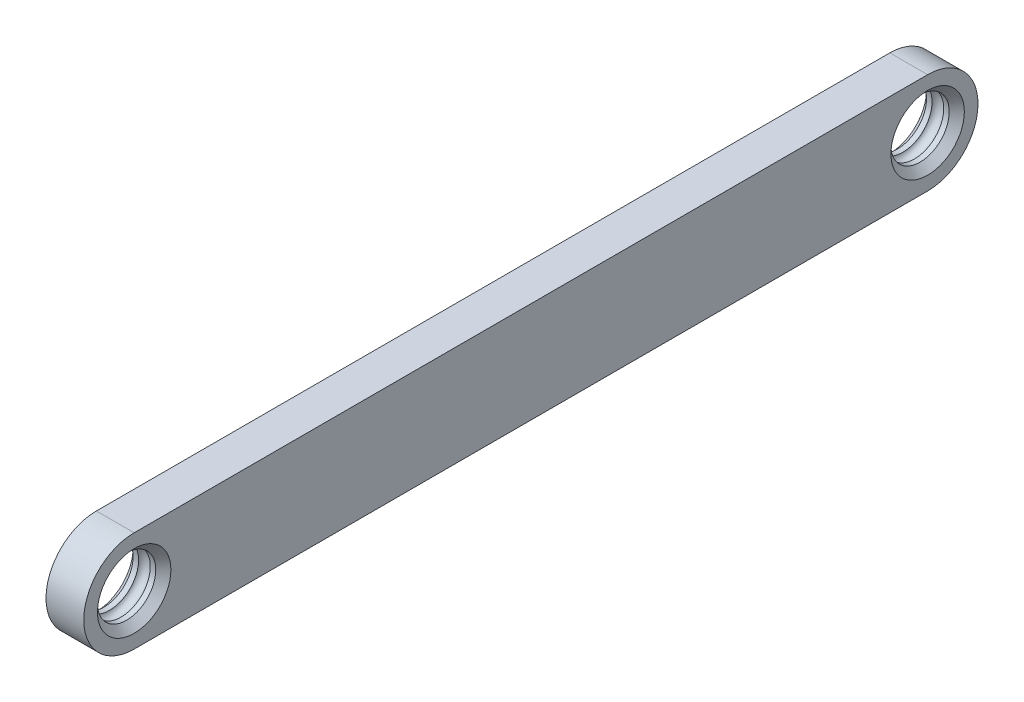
from build123d import *

# Parameters (mm, degrees)
SKETCH1_R           = 3.675
BOSS_EXTRUDE1_DEPTH = 4.7625
CHAMFER1_SIZE       = 0.9525
SKETCH2_R           = 0.79375


with BuildPart() as part:
    # Sketch1 → Boss-Extrude1 (new body)
    with BuildSketch(Plane(origin=(0, 0, 0), x_dir=(0, 0, -1), z_dir=(1, 0, 0))):
        with BuildLine():
            Line((0, 6.35), (99.999999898, 6.35))
            ThreePointArc((99.999999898, 6.35), (106.349999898, 0), (99.999999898, -6.35))
            Line((99.999999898, -6.35), (0, -6.35))
            ThreePointArc((0, -6.35), (-6.35, 0), (0, 6.35))
        make_face()
        with Locations(Location((0, 0, 0), (0, 0, 180))):
            Circle(SKETCH1_R, mode=Mode.SUBTRACT)
        with Locations(Location((99.999999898, 0, 0), (0, 0, 180))):
            Circle(SKETCH1_R, mode=Mode.SUBTRACT)
    extrude(amount=BOSS_EXTRUDE1_DEPTH)

    # Chamfer1
    chamfer1_edges = [part.edges().sort_by_distance(p)[0] for p in [
        (0, 0, -3.675),
        (0, 0, -103.674999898),
        (4.7625, 0, -3.675),
        (4.7625, 0, -103.674999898),
    ]]
    chamfer(chamfer1_edges, length=CHAMFER1_SIZE)

    # Sketch2 → Cut-Revolve1 (revolve, cut)
    with BuildSketch(Plane(origin=(0, 0, 0), x_dir=(1, 0, 0), z_dir=(0, 1, 0))):
        with Locations((2.38125, -3.375)):
            Circle(SKETCH2_R)
    cut_revolve1 = revolve(axis=Axis((0.4525, 0, 0), (1, 0, 0)), mode=Mode.SUBTRACT)

    # Sketch-Pattern2: Cut-Revolve1 at 1 more place
    with Locations((0, 0, -100)):
        add(cut_revolve1, mode=Mode.SUBTRACT)


solid = part.part
